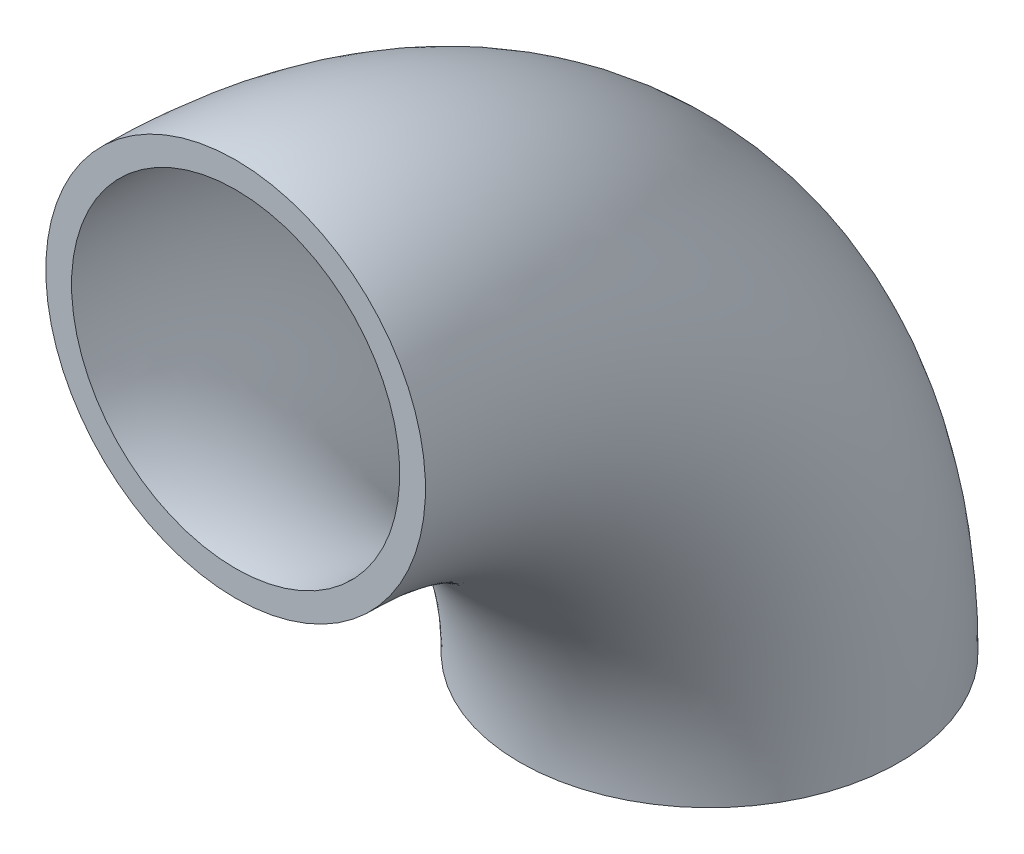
ISO-10303-21;
HEADER;
FILE_DESCRIPTION(('STEP AP214'),'2;1');
FILE_NAME('part.step','',(''),(''),'','','');
FILE_SCHEMA(('AUTOMOTIVE_DESIGN { 1 0 10303 214 1 1 1 1 }'));
ENDSEC;
DATA;
#1=APPLICATION_CONTEXT('core data for automotive mechanical design processes');
#2=APPLICATION_PROTOCOL_DEFINITION('international standard','automotive_design',2000,#1);
#3=PRODUCT_CONTEXT('',#1,'mechanical');
#4=PRODUCT('Part','Part','',(#3));
#5=PRODUCT_RELATED_PRODUCT_CATEGORY('part','',(#4));
#6=PRODUCT_DEFINITION_FORMATION('','',#4);
#7=PRODUCT_DEFINITION_CONTEXT('part definition',#1,'design');
#8=PRODUCT_DEFINITION('design','',#6,#7);
#9=PRODUCT_DEFINITION_SHAPE('','',#8);
#10=(LENGTH_UNIT() NAMED_UNIT(*) SI_UNIT(.MILLI.,.METRE.));
#11=(NAMED_UNIT(*) PLANE_ANGLE_UNIT() SI_UNIT($,.RADIAN.));
#12=(NAMED_UNIT(*) SI_UNIT($,.STERADIAN.) SOLID_ANGLE_UNIT());
#13=UNCERTAINTY_MEASURE_WITH_UNIT(LENGTH_MEASURE(1.E-05),#10,'distance_accuracy_value','');
#14=(GEOMETRIC_REPRESENTATION_CONTEXT(3) GLOBAL_UNCERTAINTY_ASSIGNED_CONTEXT((#13)) GLOBAL_UNIT_ASSIGNED_CONTEXT((#10,
#11,#12)) REPRESENTATION_CONTEXT('',''));
#15=CARTESIAN_POINT('',(0.,0.,0.));
#16=DIRECTION('',(0.,0.,1.));
#17=DIRECTION('',(1.,0.,0.));
#18=AXIS2_PLACEMENT_3D('',#15,#16,#17);
#19=CARTESIAN_POINT('',(0.,-95.,0.));
#20=DIRECTION('',(1.,0.,0.));
#21=DIRECTION('',(0.,0.,-1.));
#22=AXIS2_PLACEMENT_3D('',#19,#20,#21);
#23=TOROIDAL_SURFACE('',#22,95.,32.89);
#24=CARTESIAN_POINT('',(0.,-95.,-95.));
#25=DIRECTION('',(0.,1.,0.));
#26=DIRECTION('',(1.,0.,0.));
#27=AXIS2_PLACEMENT_3D('',#24,#25,#26);
#28=CIRCLE('',#27,32.89);
#29=CARTESIAN_POINT('',(0.,-95.,-127.89));
#30=VERTEX_POINT('',#29);
#31=EDGE_CURVE('E45',#30,#30,#28,.T.);
#32=CARTESIAN_POINT('',(0.,0.,0.));
#33=DIRECTION('',(0.,0.,1.));
#34=DIRECTION('',(1.,0.,0.));
#35=AXIS2_PLACEMENT_3D('',#32,#33,#34);
#36=CIRCLE('',#35,32.89);
#37=CARTESIAN_POINT('',(0.,32.89,0.));
#38=VERTEX_POINT('',#37);
#39=EDGE_CURVE('E53',#38,#38,#36,.T.);
#40=CARTESIAN_POINT('',(0.,-95.,0.));
#41=DIRECTION('',(1.,0.,0.));
#42=DIRECTION('',(0.,0.,-1.));
#43=AXIS2_PLACEMENT_3D('',#40,#41,#42);
#44=CIRCLE('',#43,127.89);
#45=EDGE_CURVE('',#30,#38,#44,.T.);
#46=ORIENTED_EDGE('',*,*,#31,.F.);
#47=ORIENTED_EDGE('',*,*,#39,.T.);
#48=ORIENTED_EDGE('',*,*,#45,.T.);
#49=ORIENTED_EDGE('',*,*,#45,.F.);
#50=EDGE_LOOP('',(#46,#48,#47,#49));
#51=FACE_BOUND('',#50,.T.);
#52=ADVANCED_FACE('F38',(#51),#23,.F.);
#53=CARTESIAN_POINT('',(0.,-95.,0.));
#54=DIRECTION('',(1.,0.,0.));
#55=DIRECTION('',(0.,0.,-1.));
#56=AXIS2_PLACEMENT_3D('',#53,#54,#55);
#57=TOROIDAL_SURFACE('',#56,95.,38.05);
#58=CARTESIAN_POINT('',(0.,-95.,-95.));
#59=DIRECTION('',(0.,1.,0.));
#60=DIRECTION('',(1.,0.,0.));
#61=AXIS2_PLACEMENT_3D('',#58,#59,#60);
#62=CIRCLE('',#61,38.05);
#63=CARTESIAN_POINT('',(0.,-95.,-133.05));
#64=VERTEX_POINT('',#63);
#65=EDGE_CURVE('E10',#64,#64,#62,.T.);
#66=CARTESIAN_POINT('',(0.,0.,0.));
#67=DIRECTION('',(0.,0.,1.));
#68=DIRECTION('',(1.,0.,0.));
#69=AXIS2_PLACEMENT_3D('',#66,#67,#68);
#70=CIRCLE('',#69,38.05);
#71=CARTESIAN_POINT('',(0.,38.05,0.));
#72=VERTEX_POINT('',#71);
#73=EDGE_CURVE('E49',#72,#72,#70,.T.);
#74=CARTESIAN_POINT('',(0.,-95.,0.));
#75=DIRECTION('',(1.,0.,0.));
#76=DIRECTION('',(0.,0.,-1.));
#77=AXIS2_PLACEMENT_3D('',#74,#75,#76);
#78=CIRCLE('',#77,133.05);
#79=EDGE_CURVE('',#64,#72,#78,.T.);
#80=ORIENTED_EDGE('',*,*,#65,.T.);
#81=ORIENTED_EDGE('',*,*,#73,.F.);
#82=ORIENTED_EDGE('',*,*,#79,.T.);
#83=ORIENTED_EDGE('',*,*,#79,.F.);
#84=EDGE_LOOP('',(#80,#82,#81,#83));
#85=FACE_BOUND('',#84,.T.);
#86=ADVANCED_FACE('F40',(#85),#57,.T.);
#87=CARTESIAN_POINT('',(0.,-95.,-95.));
#88=DIRECTION('',(0.,1.,0.));
#89=DIRECTION('',(1.,0.,0.));
#90=AXIS2_PLACEMENT_3D('',#87,#88,#89);
#91=PLANE('',#90);
#92=ORIENTED_EDGE('',*,*,#31,.T.);
#93=EDGE_LOOP('',(#92));
#94=FACE_BOUND('',#93,.T.);
#95=ORIENTED_EDGE('',*,*,#65,.F.);
#96=EDGE_LOOP('',(#95));
#97=FACE_BOUND('',#96,.T.);
#98=ADVANCED_FACE('F63',(#94,#97),#91,.F.);
#99=CARTESIAN_POINT('',(0.,0.,0.));
#100=DIRECTION('',(0.,0.,1.));
#101=DIRECTION('',(1.,0.,0.));
#102=AXIS2_PLACEMENT_3D('',#99,#100,#101);
#103=PLANE('',#102);
#104=ORIENTED_EDGE('',*,*,#39,.F.);
#105=EDGE_LOOP('',(#104));
#106=FACE_BOUND('',#105,.T.);
#107=ORIENTED_EDGE('',*,*,#73,.T.);
#108=EDGE_LOOP('',(#107));
#109=FACE_BOUND('',#108,.T.);
#110=ADVANCED_FACE('F60',(#106,#109),#103,.T.);
#111=CLOSED_SHELL('',(#52,#86,#98,#110));
#112=MANIFOLD_SOLID_BREP('B2',#111);
#113=ADVANCED_BREP_SHAPE_REPRESENTATION('',(#18,#112),#14);
#114=SHAPE_DEFINITION_REPRESENTATION(#9,#113);
ENDSEC;
END-ISO-10303-21;
